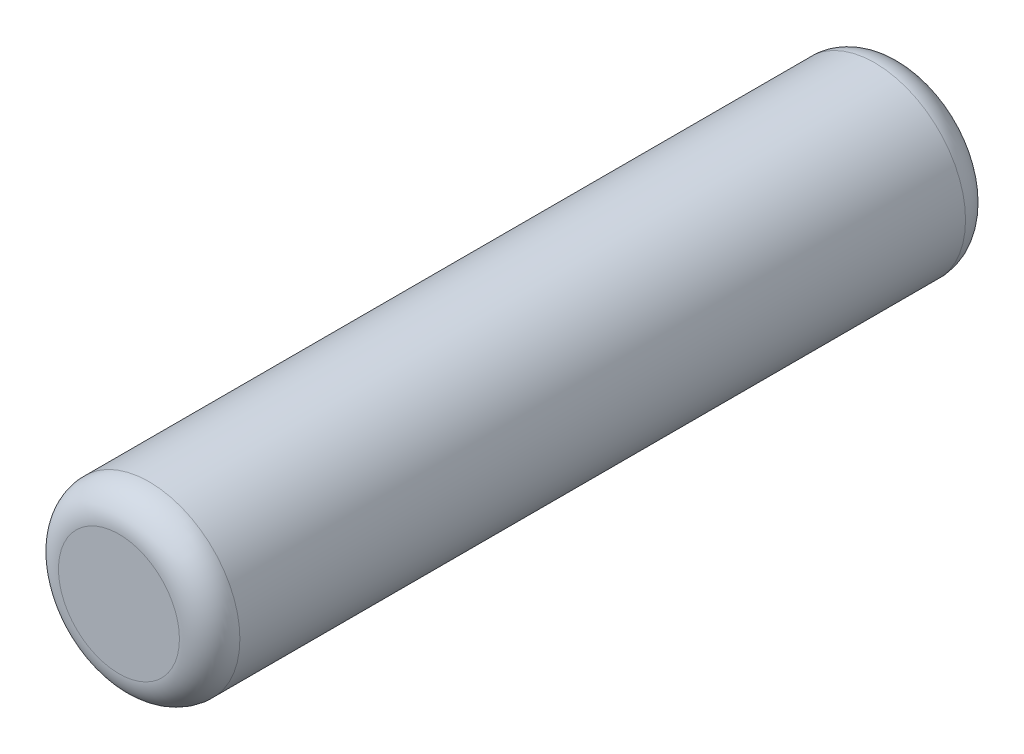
from build123d import *

# Parameters (mm, degrees)
SKETCH_1_R      = 1.5
EXTRUDE_1_DEPTH = 6.5
FILLET_1_R      = 0.5


with BuildPart() as part:
    # Sketch 1 → Extrude 1 (new, symmetric)
    with BuildSketch(Plane.XY):
        with Locations(Location((0, 0, 0), (0, 0, 180))):
            Circle(SKETCH_1_R)
    extrude(amount=EXTRUDE_1_DEPTH, both=True)

    # Fillet 1
    fillet_1_edges = [part.edges().sort_by_distance(p)[0] for p in [
        (1.5, 0, -6.5),
        (1.5, 0, 6.5),
    ]]
    fillet(fillet_1_edges, radius=FILLET_1_R)


solid = part.part
